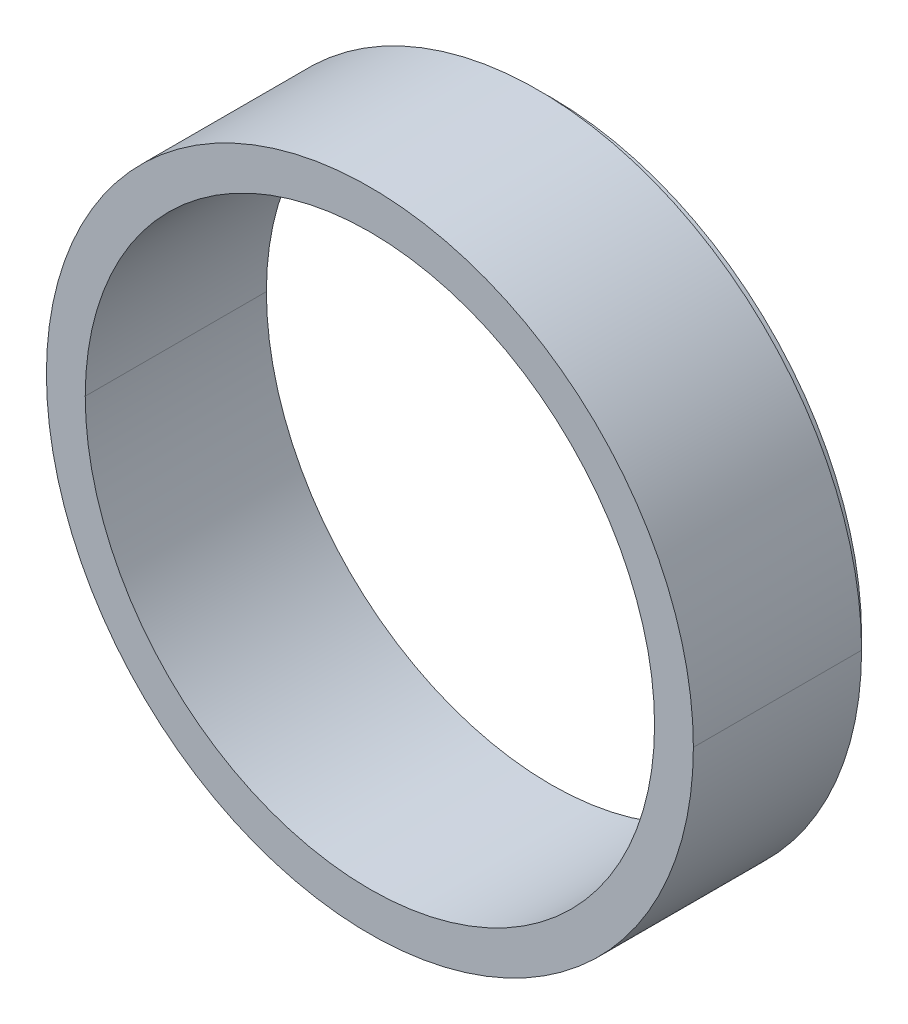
ISO-10303-21;
HEADER;
FILE_DESCRIPTION(('STEP AP214'),'2;1');
FILE_NAME('part.step','',(''),(''),'','','');
FILE_SCHEMA(('AUTOMOTIVE_DESIGN { 1 0 10303 214 1 1 1 1 }'));
ENDSEC;
DATA;
#1=APPLICATION_CONTEXT('core data for automotive mechanical design processes');
#2=APPLICATION_PROTOCOL_DEFINITION('international standard','automotive_design',2000,#1);
#3=PRODUCT_CONTEXT('',#1,'mechanical');
#4=PRODUCT('Part','Part','',(#3));
#5=PRODUCT_RELATED_PRODUCT_CATEGORY('part','',(#4));
#6=PRODUCT_DEFINITION_FORMATION('','',#4);
#7=PRODUCT_DEFINITION_CONTEXT('part definition',#1,'design');
#8=PRODUCT_DEFINITION('design','',#6,#7);
#9=PRODUCT_DEFINITION_SHAPE('','',#8);
#10=(LENGTH_UNIT() NAMED_UNIT(*) SI_UNIT(.MILLI.,.METRE.));
#11=(NAMED_UNIT(*) PLANE_ANGLE_UNIT() SI_UNIT($,.RADIAN.));
#12=(NAMED_UNIT(*) SI_UNIT($,.STERADIAN.) SOLID_ANGLE_UNIT());
#13=UNCERTAINTY_MEASURE_WITH_UNIT(LENGTH_MEASURE(1.E-05),#10,'distance_accuracy_value','');
#14=(GEOMETRIC_REPRESENTATION_CONTEXT(3) GLOBAL_UNCERTAINTY_ASSIGNED_CONTEXT((#13)) GLOBAL_UNIT_ASSIGNED_CONTEXT((#10,
#11,#12)) REPRESENTATION_CONTEXT('',''));
#15=CARTESIAN_POINT('',(0.,0.,0.));
#16=DIRECTION('',(0.,0.,1.));
#17=DIRECTION('',(1.,0.,0.));
#18=AXIS2_PLACEMENT_3D('',#15,#16,#17);
#19=CARTESIAN_POINT('',(24.,0.,1.));
#20=DIRECTION('',(0.,0.,-1.));
#21=DIRECTION('',(0.,-1.,0.));
#22=AXIS2_PLACEMENT_3D('',#19,#20,#21);
#23=PLANE('',#22);
#24=CARTESIAN_POINT('',(0.,0.,1.));
#25=DIRECTION('',(0.,0.,-1.));
#26=DIRECTION('',(-1.,0.,0.));
#27=AXIS2_PLACEMENT_3D('',#24,#25,#26);
#28=CIRCLE('',#27,24.);
#29=CARTESIAN_POINT('',(-24.,0.,1.));
#30=VERTEX_POINT('',#29);
#31=CARTESIAN_POINT('',(24.,0.,1.));
#32=VERTEX_POINT('',#31);
#33=EDGE_CURVE('E265',#30,#32,#28,.T.);
#34=ORIENTED_EDGE('',*,*,#33,.F.);
#35=CARTESIAN_POINT('',(0.,0.,1.));
#36=DIRECTION('',(0.,0.,-1.));
#37=DIRECTION('',(-1.,0.,0.));
#38=AXIS2_PLACEMENT_3D('',#35,#36,#37);
#39=CIRCLE('',#38,24.);
#40=EDGE_CURVE('E10',#32,#30,#39,.T.);
#41=ORIENTED_EDGE('',*,*,#40,.F.);
#42=EDGE_LOOP('',(#34,#41));
#43=FACE_BOUND('',#42,.T.);
#44=CARTESIAN_POINT('',(0.,0.,1.));
#45=DIRECTION('',(0.,0.,-1.));
#46=DIRECTION('',(-1.,0.,0.));
#47=AXIS2_PLACEMENT_3D('',#44,#45,#46);
#48=CIRCLE('',#47,25.);
#49=CARTESIAN_POINT('',(-25.,0.,1.));
#50=VERTEX_POINT('',#49);
#51=CARTESIAN_POINT('',(25.,0.,1.));
#52=VERTEX_POINT('',#51);
#53=EDGE_CURVE('E87',#50,#52,#48,.T.);
#54=ORIENTED_EDGE('',*,*,#53,.T.);
#55=CARTESIAN_POINT('',(0.,0.,1.));
#56=DIRECTION('',(0.,0.,-1.));
#57=DIRECTION('',(-1.,0.,0.));
#58=AXIS2_PLACEMENT_3D('',#55,#56,#57);
#59=CIRCLE('',#58,25.);
#60=EDGE_CURVE('E34',#52,#50,#59,.T.);
#61=ORIENTED_EDGE('',*,*,#60,.T.);
#62=EDGE_LOOP('',(#54,#61));
#63=FACE_BOUND('',#62,.T.);
#64=ADVANCED_FACE('F15',(#43,#63),#23,.T.);
#65=CARTESIAN_POINT('',(0.,0.,-5.82941494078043));
#66=DIRECTION('',(0.,0.,-1.));
#67=DIRECTION('',(-1.,0.,0.));
#68=AXIS2_PLACEMENT_3D('',#65,#66,#67);
#69=CYLINDRICAL_SURFACE('',#68,24.);
#70=DIRECTION('',(0.,0.,-1.));
#71=VECTOR('',#70,1.);
#72=CARTESIAN_POINT('',(24.,0.,-5.82941494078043));
#73=LINE('',#72,#71);
#74=CARTESIAN_POINT('',(24.,0.,0.));
#75=VERTEX_POINT('',#74);
#76=EDGE_CURVE('E258',#32,#75,#73,.T.);
#77=ORIENTED_EDGE('',*,*,#76,.F.);
#78=ORIENTED_EDGE('',*,*,#40,.T.);
#79=DIRECTION('',(0.,0.,-1.));
#80=VECTOR('',#79,1.);
#81=CARTESIAN_POINT('',(-24.,0.,-5.82941494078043));
#82=LINE('',#81,#80);
#83=CARTESIAN_POINT('',(-24.,0.,0.));
#84=VERTEX_POINT('',#83);
#85=EDGE_CURVE('E118',#30,#84,#82,.T.);
#86=ORIENTED_EDGE('',*,*,#85,.T.);
#87=CARTESIAN_POINT('',(0.,0.,0.));
#88=DIRECTION('',(0.,0.,-1.));
#89=DIRECTION('',(-1.,0.,0.));
#90=AXIS2_PLACEMENT_3D('',#87,#88,#89);
#91=CIRCLE('',#90,24.);
#92=EDGE_CURVE('E102',#75,#84,#91,.T.);
#93=ORIENTED_EDGE('',*,*,#92,.F.);
#94=EDGE_LOOP('',(#77,#78,#86,#93));
#95=FACE_BOUND('',#94,.T.);
#96=ADVANCED_FACE('F145',(#95),#69,.T.);
#97=CARTESIAN_POINT('',(0.,0.,14.));
#98=DIRECTION('',(0.,0.,-1.));
#99=DIRECTION('',(-1.,0.,0.));
#100=AXIS2_PLACEMENT_3D('',#97,#98,#99);
#101=CYLINDRICAL_SURFACE('',#100,22.);
#102=DIRECTION('',(0.,0.,-1.));
#103=VECTOR('',#102,1.);
#104=CARTESIAN_POINT('',(22.,0.,14.));
#105=LINE('',#104,#103);
#106=CARTESIAN_POINT('',(22.,0.,14.));
#107=VERTEX_POINT('',#106);
#108=CARTESIAN_POINT('',(22.,0.,0.));
#109=VERTEX_POINT('',#108);
#110=EDGE_CURVE('E123',#107,#109,#105,.T.);
#111=ORIENTED_EDGE('',*,*,#110,.F.);
#112=CARTESIAN_POINT('',(0.,0.,14.));
#113=DIRECTION('',(0.,0.,1.));
#114=DIRECTION('',(1.,0.,0.));
#115=AXIS2_PLACEMENT_3D('',#112,#113,#114);
#116=CIRCLE('',#115,22.);
#117=CARTESIAN_POINT('',(-22.,0.,14.));
#118=VERTEX_POINT('',#117);
#119=EDGE_CURVE('E24',#107,#118,#116,.T.);
#120=ORIENTED_EDGE('',*,*,#119,.T.);
#121=DIRECTION('',(0.,0.,-1.));
#122=VECTOR('',#121,1.);
#123=CARTESIAN_POINT('',(-22.,0.,14.));
#124=LINE('',#123,#122);
#125=CARTESIAN_POINT('',(-22.,0.,0.));
#126=VERTEX_POINT('',#125);
#127=EDGE_CURVE('E92',#118,#126,#124,.T.);
#128=ORIENTED_EDGE('',*,*,#127,.T.);
#129=CARTESIAN_POINT('',(0.,0.,0.));
#130=DIRECTION('',(0.,0.,1.));
#131=DIRECTION('',(1.,0.,0.));
#132=AXIS2_PLACEMENT_3D('',#129,#130,#131);
#133=CIRCLE('',#132,22.);
#134=EDGE_CURVE('E79',#109,#126,#133,.T.);
#135=ORIENTED_EDGE('',*,*,#134,.F.);
#136=EDGE_LOOP('',(#111,#120,#128,#135));
#137=FACE_BOUND('',#136,.T.);
#138=ADVANCED_FACE('F17',(#137),#101,.F.);
#139=CARTESIAN_POINT('',(0.,0.,14.));
#140=DIRECTION('',(0.,0.,1.));
#141=DIRECTION('',(1.,0.,0.));
#142=AXIS2_PLACEMENT_3D('',#139,#140,#141);
#143=PLANE('',#142);
#144=CARTESIAN_POINT('',(0.,0.,14.));
#145=DIRECTION('',(0.,0.,1.));
#146=DIRECTION('',(1.,0.,0.));
#147=AXIS2_PLACEMENT_3D('',#144,#145,#146);
#148=CIRCLE('',#147,22.);
#149=EDGE_CURVE('E120',#118,#107,#148,.T.);
#150=ORIENTED_EDGE('',*,*,#149,.F.);
#151=ORIENTED_EDGE('',*,*,#119,.F.);
#152=EDGE_LOOP('',(#150,#151));
#153=FACE_BOUND('',#152,.T.);
#154=CARTESIAN_POINT('',(0.,0.,14.));
#155=DIRECTION('',(0.,0.,1.));
#156=DIRECTION('',(1.,0.,0.));
#157=AXIS2_PLACEMENT_3D('',#154,#155,#156);
#158=CIRCLE('',#157,25.);
#159=CARTESIAN_POINT('',(-25.,0.,14.));
#160=VERTEX_POINT('',#159);
#161=CARTESIAN_POINT('',(25.,0.,14.));
#162=VERTEX_POINT('',#161);
#163=EDGE_CURVE('E73',#160,#162,#158,.T.);
#164=ORIENTED_EDGE('',*,*,#163,.T.);
#165=CARTESIAN_POINT('',(0.,0.,14.));
#166=DIRECTION('',(0.,0.,1.));
#167=DIRECTION('',(1.,0.,0.));
#168=AXIS2_PLACEMENT_3D('',#165,#166,#167);
#169=CIRCLE('',#168,25.);
#170=EDGE_CURVE('E76',#162,#160,#169,.T.);
#171=ORIENTED_EDGE('',*,*,#170,.T.);
#172=EDGE_LOOP('',(#164,#171));
#173=FACE_BOUND('',#172,.T.);
#174=ADVANCED_FACE('F74',(#153,#173),#143,.T.);
#175=CARTESIAN_POINT('',(0.,0.,14.));
#176=DIRECTION('',(0.,0.,-1.));
#177=DIRECTION('',(-1.,0.,0.));
#178=AXIS2_PLACEMENT_3D('',#175,#176,#177);
#179=CYLINDRICAL_SURFACE('',#178,25.);
#180=DIRECTION('',(0.,0.,-1.));
#181=VECTOR('',#180,1.);
#182=CARTESIAN_POINT('',(25.,0.,14.));
#183=LINE('',#182,#181);
#184=EDGE_CURVE('E82',#162,#52,#183,.T.);
#185=ORIENTED_EDGE('',*,*,#184,.F.);
#186=ORIENTED_EDGE('',*,*,#163,.F.);
#187=DIRECTION('',(0.,0.,-1.));
#188=VECTOR('',#187,1.);
#189=CARTESIAN_POINT('',(-25.,0.,14.));
#190=LINE('',#189,#188);
#191=EDGE_CURVE('E90',#160,#50,#190,.T.);
#192=ORIENTED_EDGE('',*,*,#191,.T.);
#193=ORIENTED_EDGE('',*,*,#60,.F.);
#194=EDGE_LOOP('',(#185,#186,#192,#193));
#195=FACE_BOUND('',#194,.T.);
#196=ADVANCED_FACE('F83',(#195),#179,.T.);
#197=CARTESIAN_POINT('',(0.,0.,0.));
#198=DIRECTION('',(0.,0.,1.));
#199=DIRECTION('',(1.,0.,0.));
#200=AXIS2_PLACEMENT_3D('',#197,#198,#199);
#201=PLANE('',#200);
#202=CARTESIAN_POINT('',(0.,0.,0.));
#203=DIRECTION('',(0.,0.,1.));
#204=DIRECTION('',(1.,0.,0.));
#205=AXIS2_PLACEMENT_3D('',#202,#203,#204);
#206=CIRCLE('',#205,22.);
#207=EDGE_CURVE('E98',#126,#109,#206,.T.);
#208=ORIENTED_EDGE('',*,*,#207,.T.);
#209=ORIENTED_EDGE('',*,*,#134,.T.);
#210=EDGE_LOOP('',(#208,#209));
#211=FACE_BOUND('',#210,.T.);
#212=CARTESIAN_POINT('',(0.,0.,0.));
#213=DIRECTION('',(0.,0.,-1.));
#214=DIRECTION('',(-1.,0.,0.));
#215=AXIS2_PLACEMENT_3D('',#212,#213,#214);
#216=CIRCLE('',#215,24.);
#217=EDGE_CURVE('E262',#84,#75,#216,.T.);
#218=ORIENTED_EDGE('',*,*,#217,.T.);
#219=ORIENTED_EDGE('',*,*,#92,.T.);
#220=EDGE_LOOP('',(#218,#219));
#221=FACE_BOUND('',#220,.T.);
#222=ADVANCED_FACE('F132',(#211,#221),#201,.F.);
#223=CARTESIAN_POINT('',(0.,0.,14.));
#224=DIRECTION('',(0.,0.,-1.));
#225=DIRECTION('',(-1.,0.,0.));
#226=AXIS2_PLACEMENT_3D('',#223,#224,#225);
#227=CYLINDRICAL_SURFACE('',#226,25.);
#228=ORIENTED_EDGE('',*,*,#170,.F.);
#229=ORIENTED_EDGE('',*,*,#184,.T.);
#230=ORIENTED_EDGE('',*,*,#53,.F.);
#231=ORIENTED_EDGE('',*,*,#191,.F.);
#232=EDGE_LOOP('',(#228,#229,#230,#231));
#233=FACE_BOUND('',#232,.T.);
#234=ADVANCED_FACE('F89',(#233),#227,.T.);
#235=CARTESIAN_POINT('',(0.,0.,14.));
#236=DIRECTION('',(0.,0.,-1.));
#237=DIRECTION('',(-1.,0.,0.));
#238=AXIS2_PLACEMENT_3D('',#235,#236,#237);
#239=CYLINDRICAL_SURFACE('',#238,22.);
#240=ORIENTED_EDGE('',*,*,#149,.T.);
#241=ORIENTED_EDGE('',*,*,#110,.T.);
#242=ORIENTED_EDGE('',*,*,#207,.F.);
#243=ORIENTED_EDGE('',*,*,#127,.F.);
#244=EDGE_LOOP('',(#240,#241,#242,#243));
#245=FACE_BOUND('',#244,.T.);
#246=ADVANCED_FACE('F135',(#245),#239,.F.);
#247=CARTESIAN_POINT('',(0.,0.,-5.82941494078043));
#248=DIRECTION('',(0.,0.,-1.));
#249=DIRECTION('',(-1.,0.,0.));
#250=AXIS2_PLACEMENT_3D('',#247,#248,#249);
#251=CYLINDRICAL_SURFACE('',#250,24.);
#252=ORIENTED_EDGE('',*,*,#33,.T.);
#253=ORIENTED_EDGE('',*,*,#76,.T.);
#254=ORIENTED_EDGE('',*,*,#217,.F.);
#255=ORIENTED_EDGE('',*,*,#85,.F.);
#256=EDGE_LOOP('',(#252,#253,#254,#255));
#257=FACE_BOUND('',#256,.T.);
#258=ADVANCED_FACE('F177',(#257),#251,.T.);
#259=CLOSED_SHELL('',(#64,#96,#138,#174,#196,#222,#234,#246,#258));
#260=MANIFOLD_SOLID_BREP('B1',#259);
#261=ADVANCED_BREP_SHAPE_REPRESENTATION('',(#18,#260),#14);
#262=SHAPE_DEFINITION_REPRESENTATION(#9,#261);
ENDSEC;
END-ISO-10303-21;
